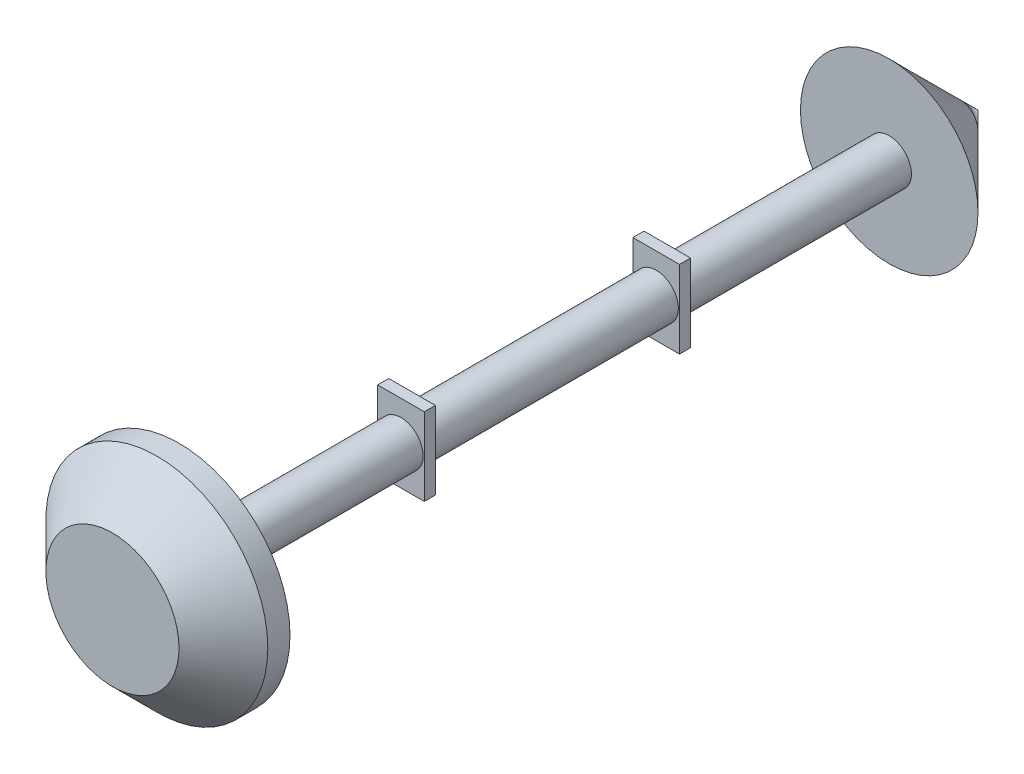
ISO-10303-21;
HEADER;
FILE_DESCRIPTION(('STEP AP214'),'2;1');
FILE_NAME('part.step','',(''),(''),'','','');
FILE_SCHEMA(('AUTOMOTIVE_DESIGN { 1 0 10303 214 1 1 1 1 }'));
ENDSEC;
DATA;
#1=APPLICATION_CONTEXT('core data for automotive mechanical design processes');
#2=APPLICATION_PROTOCOL_DEFINITION('international standard','automotive_design',2000,#1);
#3=PRODUCT_CONTEXT('',#1,'mechanical');
#4=PRODUCT('Part','Part','',(#3));
#5=PRODUCT_RELATED_PRODUCT_CATEGORY('part','',(#4));
#6=PRODUCT_DEFINITION_FORMATION('','',#4);
#7=PRODUCT_DEFINITION_CONTEXT('part definition',#1,'design');
#8=PRODUCT_DEFINITION('design','',#6,#7);
#9=PRODUCT_DEFINITION_SHAPE('','',#8);
#10=(LENGTH_UNIT() NAMED_UNIT(*) SI_UNIT(.MILLI.,.METRE.));
#11=(NAMED_UNIT(*) PLANE_ANGLE_UNIT() SI_UNIT($,.RADIAN.));
#12=(NAMED_UNIT(*) SI_UNIT($,.STERADIAN.) SOLID_ANGLE_UNIT());
#13=UNCERTAINTY_MEASURE_WITH_UNIT(LENGTH_MEASURE(1.E-05),#10,'distance_accuracy_value','');
#14=(GEOMETRIC_REPRESENTATION_CONTEXT(3) GLOBAL_UNCERTAINTY_ASSIGNED_CONTEXT((#13)) GLOBAL_UNIT_ASSIGNED_CONTEXT((#10,
#11,#12)) REPRESENTATION_CONTEXT('',''));
#15=CARTESIAN_POINT('',(0.,0.,0.));
#16=DIRECTION('',(0.,0.,1.));
#17=DIRECTION('',(1.,0.,0.));
#18=AXIS2_PLACEMENT_3D('',#15,#16,#17);
#19=CARTESIAN_POINT('',(10.5,17.5,-120.));
#20=DIRECTION('',(0.,0.,-1.));
#21=DIRECTION('',(-1.,0.,0.));
#22=AXIS2_PLACEMENT_3D('',#19,#20,#21);
#23=PLANE('',#22);
#24=DIRECTION('',(1.,0.,0.));
#25=VECTOR('',#24,1.);
#26=CARTESIAN_POINT('',(-10.5,17.5,-120.));
#27=LINE('',#26,#25);
#28=CARTESIAN_POINT('',(-10.5,17.5,-120.));
#29=VERTEX_POINT('',#28);
#30=CARTESIAN_POINT('',(10.5,17.5,-120.));
#31=VERTEX_POINT('',#30);
#32=EDGE_CURVE('E255',#29,#31,#27,.T.);
#33=ORIENTED_EDGE('',*,*,#32,.T.);
#34=DIRECTION('',(0.,-1.,0.));
#35=VECTOR('',#34,1.);
#36=CARTESIAN_POINT('',(10.5,17.5,-120.));
#37=LINE('',#36,#35);
#38=CARTESIAN_POINT('',(10.5,-17.5,-120.));
#39=VERTEX_POINT('',#38);
#40=EDGE_CURVE('E257',#31,#39,#37,.T.);
#41=ORIENTED_EDGE('',*,*,#40,.T.);
#42=DIRECTION('',(-1.,0.,0.));
#43=VECTOR('',#42,1.);
#44=CARTESIAN_POINT('',(10.5,-17.5,-120.));
#45=LINE('',#44,#43);
#46=CARTESIAN_POINT('',(-10.5,-17.5,-120.));
#47=VERTEX_POINT('',#46);
#48=EDGE_CURVE('E259',#39,#47,#45,.T.);
#49=ORIENTED_EDGE('',*,*,#48,.T.);
#50=DIRECTION('',(0.,1.,0.));
#51=VECTOR('',#50,1.);
#52=CARTESIAN_POINT('',(-10.5,-17.5,-120.));
#53=LINE('',#52,#51);
#54=EDGE_CURVE('E261',#47,#29,#53,.T.);
#55=ORIENTED_EDGE('',*,*,#54,.T.);
#56=EDGE_LOOP('',(#33,#41,#49,#55));
#57=FACE_BOUND('',#56,.T.);
#58=CARTESIAN_POINT('',(0.,0.,-120.));
#59=DIRECTION('',(0.,0.,-1.));
#60=DIRECTION('',(-1.,0.,0.));
#61=AXIS2_PLACEMENT_3D('',#58,#59,#60);
#62=CIRCLE('',#61,10.);
#63=CARTESIAN_POINT('',(-10.,0.,-120.));
#64=VERTEX_POINT('',#63);
#65=EDGE_CURVE('E237',#64,#64,#62,.T.);
#66=ORIENTED_EDGE('',*,*,#65,.F.);
#67=EDGE_LOOP('',(#66));
#68=FACE_BOUND('',#67,.T.);
#69=ADVANCED_FACE('F32',(#57,#68),#23,.T.);
#70=CARTESIAN_POINT('',(10.5,-17.5,-5.));
#71=DIRECTION('',(0.,0.,-1.));
#72=DIRECTION('',(-1.,0.,0.));
#73=AXIS2_PLACEMENT_3D('',#70,#71,#72);
#74=PLANE('',#73);
#75=DIRECTION('',(0.,-1.,0.));
#76=VECTOR('',#75,1.);
#77=CARTESIAN_POINT('',(10.5,17.5,-5.));
#78=LINE('',#77,#76);
#79=CARTESIAN_POINT('',(10.5,17.5,-5.));
#80=VERTEX_POINT('',#79);
#81=CARTESIAN_POINT('',(10.5,-17.5,-5.));
#82=VERTEX_POINT('',#81);
#83=EDGE_CURVE('E192',#80,#82,#78,.T.);
#84=ORIENTED_EDGE('',*,*,#83,.T.);
#85=DIRECTION('',(-1.,0.,0.));
#86=VECTOR('',#85,1.);
#87=CARTESIAN_POINT('',(10.5,-17.5,-5.));
#88=LINE('',#87,#86);
#89=CARTESIAN_POINT('',(-10.5,-17.5,-5.));
#90=VERTEX_POINT('',#89);
#91=EDGE_CURVE('E194',#82,#90,#88,.T.);
#92=ORIENTED_EDGE('',*,*,#91,.T.);
#93=DIRECTION('',(0.,1.,0.));
#94=VECTOR('',#93,1.);
#95=CARTESIAN_POINT('',(-10.5,17.5,-5.));
#96=LINE('',#95,#94);
#97=CARTESIAN_POINT('',(-10.5,17.5,-5.));
#98=VERTEX_POINT('',#97);
#99=EDGE_CURVE('E52',#90,#98,#96,.T.);
#100=ORIENTED_EDGE('',*,*,#99,.T.);
#101=DIRECTION('',(1.,0.,0.));
#102=VECTOR('',#101,1.);
#103=CARTESIAN_POINT('',(10.5,17.5,-5.));
#104=LINE('',#103,#102);
#105=EDGE_CURVE('E47',#98,#80,#104,.T.);
#106=ORIENTED_EDGE('',*,*,#105,.T.);
#107=EDGE_LOOP('',(#84,#92,#100,#106));
#108=FACE_BOUND('',#107,.T.);
#109=CARTESIAN_POINT('',(0.,0.,-5.));
#110=DIRECTION('',(0.,0.,-1.));
#111=DIRECTION('',(-1.,0.,0.));
#112=AXIS2_PLACEMENT_3D('',#109,#110,#111);
#113=CIRCLE('',#112,10.);
#114=CARTESIAN_POINT('',(-10.,0.,-5.));
#115=VERTEX_POINT('',#114);
#116=EDGE_CURVE('E185',#115,#115,#113,.T.);
#117=ORIENTED_EDGE('',*,*,#116,.F.);
#118=EDGE_LOOP('',(#117));
#119=FACE_BOUND('',#118,.T.);
#120=ADVANCED_FACE('F115',(#108,#119),#74,.T.);
#121=CARTESIAN_POINT('',(0.,0.,100.));
#122=DIRECTION('',(0.,0.,-1.));
#123=DIRECTION('',(-1.,0.,0.));
#124=AXIS2_PLACEMENT_3D('',#121,#122,#123);
#125=CYLINDRICAL_SURFACE('',#124,10.);
#126=CARTESIAN_POINT('',(0.,0.,100.));
#127=DIRECTION('',(0.,0.,1.));
#128=DIRECTION('',(1.,0.,0.));
#129=AXIS2_PLACEMENT_3D('',#126,#127,#128);
#130=CIRCLE('',#129,10.);
#131=CARTESIAN_POINT('',(10.,0.,100.));
#132=VERTEX_POINT('',#131);
#133=EDGE_CURVE('E209',#132,#132,#130,.T.);
#134=ORIENTED_EDGE('',*,*,#133,.F.);
#135=EDGE_LOOP('',(#134));
#136=FACE_BOUND('',#135,.T.);
#137=CARTESIAN_POINT('',(0.,0.,0.));
#138=DIRECTION('',(0.,0.,-1.));
#139=DIRECTION('',(-1.,0.,0.));
#140=AXIS2_PLACEMENT_3D('',#137,#138,#139);
#141=CIRCLE('',#140,10.);
#142=CARTESIAN_POINT('',(-10.,0.,0.));
#143=VERTEX_POINT('',#142);
#144=EDGE_CURVE('E206',#143,#143,#141,.T.);
#145=ORIENTED_EDGE('',*,*,#144,.F.);
#146=EDGE_LOOP('',(#145));
#147=FACE_BOUND('',#146,.T.);
#148=ADVANCED_FACE('F34',(#136,#147),#125,.T.);
#149=CARTESIAN_POINT('',(10.5,-17.5,0.));
#150=DIRECTION('',(0.,0.,-1.));
#151=DIRECTION('',(-1.,0.,0.));
#152=AXIS2_PLACEMENT_3D('',#149,#150,#151);
#153=PLANE('',#152);
#154=DIRECTION('',(0.,-1.,0.));
#155=VECTOR('',#154,1.);
#156=CARTESIAN_POINT('',(10.5,17.5,0.));
#157=LINE('',#156,#155);
#158=CARTESIAN_POINT('',(10.5,17.5,0.));
#159=VERTEX_POINT('',#158);
#160=CARTESIAN_POINT('',(10.5,-17.5,0.));
#161=VERTEX_POINT('',#160);
#162=EDGE_CURVE('E173',#159,#161,#157,.T.);
#163=ORIENTED_EDGE('',*,*,#162,.F.);
#164=DIRECTION('',(1.,0.,0.));
#165=VECTOR('',#164,1.);
#166=CARTESIAN_POINT('',(10.5,17.5,0.));
#167=LINE('',#166,#165);
#168=CARTESIAN_POINT('',(-10.5,17.5,0.));
#169=VERTEX_POINT('',#168);
#170=EDGE_CURVE('E190',#169,#159,#167,.T.);
#171=ORIENTED_EDGE('',*,*,#170,.F.);
#172=DIRECTION('',(0.,1.,0.));
#173=VECTOR('',#172,1.);
#174=CARTESIAN_POINT('',(-10.5,17.5,0.));
#175=LINE('',#174,#173);
#176=CARTESIAN_POINT('',(-10.5,-17.5,0.));
#177=VERTEX_POINT('',#176);
#178=EDGE_CURVE('E182',#177,#169,#175,.T.);
#179=ORIENTED_EDGE('',*,*,#178,.F.);
#180=DIRECTION('',(-1.,0.,0.));
#181=VECTOR('',#180,1.);
#182=CARTESIAN_POINT('',(10.5,-17.5,0.));
#183=LINE('',#182,#181);
#184=EDGE_CURVE('E179',#161,#177,#183,.T.);
#185=ORIENTED_EDGE('',*,*,#184,.F.);
#186=EDGE_LOOP('',(#163,#171,#179,#185));
#187=FACE_BOUND('',#186,.T.);
#188=ORIENTED_EDGE('',*,*,#144,.T.);
#189=EDGE_LOOP('',(#188));
#190=FACE_BOUND('',#189,.T.);
#191=ADVANCED_FACE('F150',(#187,#190),#153,.F.);
#192=CARTESIAN_POINT('',(10.5,17.5,-5.));
#193=DIRECTION('',(-1.,0.,0.));
#194=DIRECTION('',(0.,-1.,0.));
#195=AXIS2_PLACEMENT_3D('',#192,#193,#194);
#196=PLANE('',#195);
#197=ORIENTED_EDGE('',*,*,#162,.T.);
#198=DIRECTION('',(0.,0.,1.));
#199=VECTOR('',#198,1.);
#200=CARTESIAN_POINT('',(10.5,-17.5,-5.));
#201=LINE('',#200,#199);
#202=EDGE_CURVE('E176',#82,#161,#201,.T.);
#203=ORIENTED_EDGE('',*,*,#202,.F.);
#204=ORIENTED_EDGE('',*,*,#83,.F.);
#205=DIRECTION('',(0.,0.,1.));
#206=VECTOR('',#205,1.);
#207=CARTESIAN_POINT('',(10.5,17.5,-5.));
#208=LINE('',#207,#206);
#209=EDGE_CURVE('E177',#80,#159,#208,.T.);
#210=ORIENTED_EDGE('',*,*,#209,.T.);
#211=EDGE_LOOP('',(#197,#203,#204,#210));
#212=FACE_BOUND('',#211,.T.);
#213=ADVANCED_FACE('F152',(#212),#196,.F.);
#214=CARTESIAN_POINT('',(10.5,-17.5,-5.));
#215=DIRECTION('',(0.,1.,0.));
#216=DIRECTION('',(-1.,0.,0.));
#217=AXIS2_PLACEMENT_3D('',#214,#215,#216);
#218=PLANE('',#217);
#219=ORIENTED_EDGE('',*,*,#184,.T.);
#220=DIRECTION('',(0.,0.,1.));
#221=VECTOR('',#220,1.);
#222=CARTESIAN_POINT('',(-10.5,-17.5,-5.));
#223=LINE('',#222,#221);
#224=EDGE_CURVE('E202',#90,#177,#223,.T.);
#225=ORIENTED_EDGE('',*,*,#224,.F.);
#226=ORIENTED_EDGE('',*,*,#91,.F.);
#227=ORIENTED_EDGE('',*,*,#202,.T.);
#228=EDGE_LOOP('',(#219,#225,#226,#227));
#229=FACE_BOUND('',#228,.T.);
#230=ADVANCED_FACE('F161',(#229),#218,.F.);
#231=CARTESIAN_POINT('',(-10.5,17.5,-5.));
#232=DIRECTION('',(1.,0.,0.));
#233=DIRECTION('',(0.,1.,0.));
#234=AXIS2_PLACEMENT_3D('',#231,#232,#233);
#235=PLANE('',#234);
#236=ORIENTED_EDGE('',*,*,#178,.T.);
#237=DIRECTION('',(0.,0.,1.));
#238=VECTOR('',#237,1.);
#239=CARTESIAN_POINT('',(-10.5,17.5,-5.));
#240=LINE('',#239,#238);
#241=EDGE_CURVE('E199',#98,#169,#240,.T.);
#242=ORIENTED_EDGE('',*,*,#241,.F.);
#243=ORIENTED_EDGE('',*,*,#99,.F.);
#244=ORIENTED_EDGE('',*,*,#224,.T.);
#245=EDGE_LOOP('',(#236,#242,#243,#244));
#246=FACE_BOUND('',#245,.T.);
#247=ADVANCED_FACE('F157',(#246),#235,.F.);
#248=CARTESIAN_POINT('',(10.5,17.5,-5.));
#249=DIRECTION('',(0.,-1.,0.));
#250=DIRECTION('',(1.,0.,0.));
#251=AXIS2_PLACEMENT_3D('',#248,#249,#250);
#252=PLANE('',#251);
#253=ORIENTED_EDGE('',*,*,#170,.T.);
#254=ORIENTED_EDGE('',*,*,#209,.F.);
#255=ORIENTED_EDGE('',*,*,#105,.F.);
#256=ORIENTED_EDGE('',*,*,#241,.T.);
#257=EDGE_LOOP('',(#253,#254,#255,#256));
#258=FACE_BOUND('',#257,.T.);
#259=ADVANCED_FACE('F148',(#258),#252,.F.);
#260=CARTESIAN_POINT('',(0.,0.,-115.));
#261=DIRECTION('',(0.,0.,1.));
#262=DIRECTION('',(1.,0.,0.));
#263=AXIS2_PLACEMENT_3D('',#260,#261,#262);
#264=CYLINDRICAL_SURFACE('',#263,10.);
#265=CARTESIAN_POINT('',(0.,0.,-115.));
#266=DIRECTION('',(0.,0.,-1.));
#267=DIRECTION('',(-1.,0.,0.));
#268=AXIS2_PLACEMENT_3D('',#265,#266,#267);
#269=CIRCLE('',#268,10.);
#270=CARTESIAN_POINT('',(-10.,0.,-115.));
#271=VERTEX_POINT('',#270);
#272=EDGE_CURVE('E180',#271,#271,#269,.T.);
#273=ORIENTED_EDGE('',*,*,#272,.F.);
#274=EDGE_LOOP('',(#273));
#275=FACE_BOUND('',#274,.T.);
#276=ORIENTED_EDGE('',*,*,#116,.T.);
#277=EDGE_LOOP('',(#276));
#278=FACE_BOUND('',#277,.T.);
#279=ADVANCED_FACE('F145',(#275,#278),#264,.T.);
#280=CARTESIAN_POINT('',(10.5,17.5,-115.));
#281=DIRECTION('',(0.,0.,-1.));
#282=DIRECTION('',(-1.,0.,0.));
#283=AXIS2_PLACEMENT_3D('',#280,#281,#282);
#284=PLANE('',#283);
#285=DIRECTION('',(1.,0.,0.));
#286=VECTOR('',#285,1.);
#287=CARTESIAN_POINT('',(-10.5,17.5,-115.));
#288=LINE('',#287,#286);
#289=CARTESIAN_POINT('',(-10.5,17.5,-115.));
#290=VERTEX_POINT('',#289);
#291=CARTESIAN_POINT('',(10.5,17.5,-115.));
#292=VERTEX_POINT('',#291);
#293=EDGE_CURVE('E240',#290,#292,#288,.T.);
#294=ORIENTED_EDGE('',*,*,#293,.F.);
#295=DIRECTION('',(0.,1.,0.));
#296=VECTOR('',#295,1.);
#297=CARTESIAN_POINT('',(-10.5,-17.5,-115.));
#298=LINE('',#297,#296);
#299=CARTESIAN_POINT('',(-10.5,-17.5,-115.));
#300=VERTEX_POINT('',#299);
#301=EDGE_CURVE('E253',#300,#290,#298,.T.);
#302=ORIENTED_EDGE('',*,*,#301,.F.);
#303=DIRECTION('',(-1.,0.,0.));
#304=VECTOR('',#303,1.);
#305=CARTESIAN_POINT('',(10.5,-17.5,-115.));
#306=LINE('',#305,#304);
#307=CARTESIAN_POINT('',(10.5,-17.5,-115.));
#308=VERTEX_POINT('',#307);
#309=EDGE_CURVE('E251',#308,#300,#306,.T.);
#310=ORIENTED_EDGE('',*,*,#309,.F.);
#311=DIRECTION('',(0.,-1.,0.));
#312=VECTOR('',#311,1.);
#313=CARTESIAN_POINT('',(10.5,17.5,-115.));
#314=LINE('',#313,#312);
#315=EDGE_CURVE('E249',#292,#308,#314,.T.);
#316=ORIENTED_EDGE('',*,*,#315,.F.);
#317=EDGE_LOOP('',(#294,#302,#310,#316));
#318=FACE_BOUND('',#317,.T.);
#319=ORIENTED_EDGE('',*,*,#272,.T.);
#320=EDGE_LOOP('',(#319));
#321=FACE_BOUND('',#320,.T.);
#322=ADVANCED_FACE('F126',(#318,#321),#284,.F.);
#323=CARTESIAN_POINT('',(-10.5,17.5,-120.));
#324=DIRECTION('',(0.,-1.,0.));
#325=DIRECTION('',(1.,0.,0.));
#326=AXIS2_PLACEMENT_3D('',#323,#324,#325);
#327=PLANE('',#326);
#328=ORIENTED_EDGE('',*,*,#293,.T.);
#329=DIRECTION('',(0.,0.,1.));
#330=VECTOR('',#329,1.);
#331=CARTESIAN_POINT('',(10.5,17.5,-120.));
#332=LINE('',#331,#330);
#333=EDGE_CURVE('E272',#31,#292,#332,.T.);
#334=ORIENTED_EDGE('',*,*,#333,.F.);
#335=ORIENTED_EDGE('',*,*,#32,.F.);
#336=DIRECTION('',(0.,0.,1.));
#337=VECTOR('',#336,1.);
#338=CARTESIAN_POINT('',(-10.5,17.5,-120.));
#339=LINE('',#338,#337);
#340=EDGE_CURVE('E263',#29,#290,#339,.T.);
#341=ORIENTED_EDGE('',*,*,#340,.T.);
#342=EDGE_LOOP('',(#328,#334,#335,#341));
#343=FACE_BOUND('',#342,.T.);
#344=ADVANCED_FACE('F140',(#343),#327,.F.);
#345=CARTESIAN_POINT('',(10.5,17.5,-120.));
#346=DIRECTION('',(-1.,0.,0.));
#347=DIRECTION('',(0.,-1.,0.));
#348=AXIS2_PLACEMENT_3D('',#345,#346,#347);
#349=PLANE('',#348);
#350=ORIENTED_EDGE('',*,*,#315,.T.);
#351=DIRECTION('',(0.,0.,1.));
#352=VECTOR('',#351,1.);
#353=CARTESIAN_POINT('',(10.5,-17.5,-120.));
#354=LINE('',#353,#352);
#355=EDGE_CURVE('E269',#39,#308,#354,.T.);
#356=ORIENTED_EDGE('',*,*,#355,.F.);
#357=ORIENTED_EDGE('',*,*,#40,.F.);
#358=ORIENTED_EDGE('',*,*,#333,.T.);
#359=EDGE_LOOP('',(#350,#356,#357,#358));
#360=FACE_BOUND('',#359,.T.);
#361=ADVANCED_FACE('F136',(#360),#349,.F.);
#362=CARTESIAN_POINT('',(10.5,-17.5,-120.));
#363=DIRECTION('',(0.,1.,0.));
#364=DIRECTION('',(-1.,0.,0.));
#365=AXIS2_PLACEMENT_3D('',#362,#363,#364);
#366=PLANE('',#365);
#367=ORIENTED_EDGE('',*,*,#309,.T.);
#368=DIRECTION('',(0.,0.,1.));
#369=VECTOR('',#368,1.);
#370=CARTESIAN_POINT('',(-10.5,-17.5,-120.));
#371=LINE('',#370,#369);
#372=EDGE_CURVE('E266',#47,#300,#371,.T.);
#373=ORIENTED_EDGE('',*,*,#372,.F.);
#374=ORIENTED_EDGE('',*,*,#48,.F.);
#375=ORIENTED_EDGE('',*,*,#355,.T.);
#376=EDGE_LOOP('',(#367,#373,#374,#375));
#377=FACE_BOUND('',#376,.T.);
#378=ADVANCED_FACE('F132',(#377),#366,.F.);
#379=CARTESIAN_POINT('',(-10.5,-17.5,-120.));
#380=DIRECTION('',(1.,0.,0.));
#381=DIRECTION('',(0.,1.,0.));
#382=AXIS2_PLACEMENT_3D('',#379,#380,#381);
#383=PLANE('',#382);
#384=ORIENTED_EDGE('',*,*,#301,.T.);
#385=ORIENTED_EDGE('',*,*,#340,.F.);
#386=ORIENTED_EDGE('',*,*,#54,.F.);
#387=ORIENTED_EDGE('',*,*,#372,.T.);
#388=EDGE_LOOP('',(#384,#385,#386,#387));
#389=FACE_BOUND('',#388,.T.);
#390=ADVANCED_FACE('F128',(#389),#383,.F.);
#391=CARTESIAN_POINT('',(0.,0.,-220.));
#392=DIRECTION('',(0.,0.,1.));
#393=DIRECTION('',(1.,0.,0.));
#394=AXIS2_PLACEMENT_3D('',#391,#392,#393);
#395=CYLINDRICAL_SURFACE('',#394,10.);
#396=CARTESIAN_POINT('',(0.,0.,-220.));
#397=DIRECTION('',(0.,0.,-1.));
#398=DIRECTION('',(-1.,0.,0.));
#399=AXIS2_PLACEMENT_3D('',#396,#397,#398);
#400=CIRCLE('',#399,10.);
#401=CARTESIAN_POINT('',(-10.,0.,-220.));
#402=VERTEX_POINT('',#401);
#403=EDGE_CURVE('E234',#402,#402,#400,.T.);
#404=ORIENTED_EDGE('',*,*,#403,.F.);
#405=EDGE_LOOP('',(#404));
#406=FACE_BOUND('',#405,.T.);
#407=ORIENTED_EDGE('',*,*,#65,.T.);
#408=EDGE_LOOP('',(#407));
#409=FACE_BOUND('',#408,.T.);
#410=ADVANCED_FACE('F131',(#406,#409),#395,.T.);
#411=CARTESIAN_POINT('',(0.,0.,100.));
#412=DIRECTION('',(0.,0.,1.));
#413=DIRECTION('',(1.,0.,0.));
#414=AXIS2_PLACEMENT_3D('',#411,#412,#413);
#415=PLANE('',#414);
#416=CARTESIAN_POINT('',(0.,0.,100.));
#417=DIRECTION('',(0.,0.,1.));
#418=DIRECTION('',(1.,0.,0.));
#419=AXIS2_PLACEMENT_3D('',#416,#417,#418);
#420=CIRCLE('',#419,50.);
#421=CARTESIAN_POINT('',(50.,0.,100.));
#422=VERTEX_POINT('',#421);
#423=EDGE_CURVE('E238',#422,#422,#420,.T.);
#424=ORIENTED_EDGE('',*,*,#423,.F.);
#425=EDGE_LOOP('',(#424));
#426=FACE_BOUND('',#425,.T.);
#427=ORIENTED_EDGE('',*,*,#133,.T.);
#428=EDGE_LOOP('',(#427));
#429=FACE_BOUND('',#428,.T.);
#430=ADVANCED_FACE('F221',(#426,#429),#415,.F.);
#431=CARTESIAN_POINT('',(0.,0.,130.));
#432=DIRECTION('',(0.,0.,-1.));
#433=DIRECTION('',(-1.,0.,0.));
#434=AXIS2_PLACEMENT_3D('',#431,#432,#433);
#435=CYLINDRICAL_SURFACE('',#434,50.);
#436=CARTESIAN_POINT('',(0.,0.,110.));
#437=DIRECTION('',(0.,0.,1.));
#438=DIRECTION('',(1.,0.,0.));
#439=AXIS2_PLACEMENT_3D('',#436,#437,#438);
#440=CIRCLE('',#439,50.);
#441=CARTESIAN_POINT('',(50.,0.,110.));
#442=VERTEX_POINT('',#441);
#443=EDGE_CURVE('E11',#442,#442,#440,.F.);
#444=ORIENTED_EDGE('',*,*,#443,.T.);
#445=EDGE_LOOP('',(#444));
#446=FACE_BOUND('',#445,.T.);
#447=ORIENTED_EDGE('',*,*,#423,.T.);
#448=EDGE_LOOP('',(#447));
#449=FACE_BOUND('',#448,.T.);
#450=ADVANCED_FACE('F216',(#446,#449),#435,.T.);
#451=CARTESIAN_POINT('',(0.,0.,130.));
#452=DIRECTION('',(0.,0.,1.));
#453=DIRECTION('',(1.,0.,0.));
#454=AXIS2_PLACEMENT_3D('',#451,#452,#453);
#455=PLANE('',#454);
#456=CARTESIAN_POINT('',(0.,0.,130.));
#457=DIRECTION('',(0.,0.,1.));
#458=DIRECTION('',(1.,0.,0.));
#459=AXIS2_PLACEMENT_3D('',#456,#457,#458);
#460=CIRCLE('',#459,30.);
#461=CARTESIAN_POINT('',(30.,0.,130.));
#462=VERTEX_POINT('',#461);
#463=EDGE_CURVE('E40',#462,#462,#460,.T.);
#464=ORIENTED_EDGE('',*,*,#463,.T.);
#465=EDGE_LOOP('',(#464));
#466=FACE_BOUND('',#465,.T.);
#467=ADVANCED_FACE('F110',(#466),#455,.T.);
#468=CARTESIAN_POINT('',(0.,0.,-220.));
#469=DIRECTION('',(0.,0.,1.));
#470=DIRECTION('',(0.,-1.,0.));
#471=AXIS2_PLACEMENT_3D('',#468,#469,#470);
#472=PLANE('',#471);
#473=CARTESIAN_POINT('',(0.,0.,-220.));
#474=DIRECTION('',(0.,0.,-1.));
#475=DIRECTION('',(0.,1.,0.));
#476=AXIS2_PLACEMENT_3D('',#473,#474,#475);
#477=CIRCLE('',#476,40.);
#478=CARTESIAN_POINT('',(0.,40.,-220.));
#479=VERTEX_POINT('',#478);
#480=EDGE_CURVE('E243',#479,#479,#477,.T.);
#481=ORIENTED_EDGE('',*,*,#480,.F.);
#482=EDGE_LOOP('',(#481));
#483=FACE_BOUND('',#482,.T.);
#484=ORIENTED_EDGE('',*,*,#403,.T.);
#485=EDGE_LOOP('',(#484));
#486=FACE_BOUND('',#485,.T.);
#487=ADVANCED_FACE('F101',(#483,#486),#472,.T.);
#488=CARTESIAN_POINT('',(0.,0.,-260.));
#489=DIRECTION('',(0.,0.,1.));
#490=DIRECTION('',(0.,-1.,0.));
#491=AXIS2_PLACEMENT_3D('',#488,#489,#490);
#492=CONICAL_SURFACE('',#491,0.,0.785398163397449);
#493=ORIENTED_EDGE('',*,*,#480,.T.);
#494=EDGE_LOOP('',(#493));
#495=FACE_BOUND('',#494,.T.);
#496=CARTESIAN_POINT('',(0.,0.,-260.));
#497=VERTEX_POINT('',#496);
#498=VERTEX_LOOP('',#497);
#499=FACE_BOUND('',#498,.T.);
#500=ADVANCED_FACE('F98',(#495,#499),#492,.T.);
#501=CARTESIAN_POINT('',(0.,0.,130.));
#502=DIRECTION('',(0.,0.,-1.));
#503=DIRECTION('',(-1.,0.,0.));
#504=AXIS2_PLACEMENT_3D('',#501,#502,#503);
#505=CONICAL_SURFACE('',#504,30.,0.785398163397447);
#506=ORIENTED_EDGE('',*,*,#443,.F.);
#507=EDGE_LOOP('',(#506));
#508=FACE_BOUND('',#507,.T.);
#509=ORIENTED_EDGE('',*,*,#463,.F.);
#510=EDGE_LOOP('',(#509));
#511=FACE_BOUND('',#510,.T.);
#512=ADVANCED_FACE('F100',(#508,#511),#505,.T.);
#513=CLOSED_SHELL('',(#69,#120,#148,#191,#213,#230,#247,#259,#279,#322,#344,#361,#378,#390,#410,
#430,#450,#467,#487,#500,#512));
#514=MANIFOLD_SOLID_BREP('B2',#513);
#515=ADVANCED_BREP_SHAPE_REPRESENTATION('',(#18,#514),#14);
#516=SHAPE_DEFINITION_REPRESENTATION(#9,#515);
ENDSEC;
END-ISO-10303-21;
